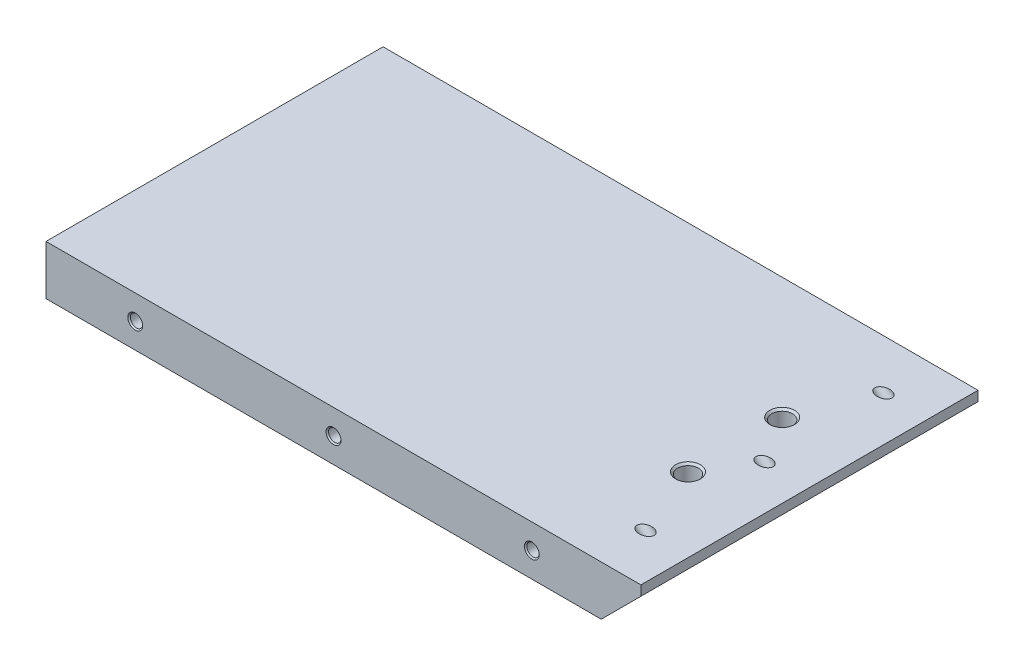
from build123d import *

# Parameters (mm, degrees)
ESQUISSE1_W                     = 120
ESQUISSE1_H                     = 10
EXTRUSION1_DEPTH                = 34
CHANFREIN1_SIZE                 = 8
R_P_TITION_LIN_AIRE1_COUNT      = 2
R_P_TITION_LIN_AIRE1_PITCH      = 58
R_P_TITION_LIN_AIRE2_COUNT      = 2
R_P_TITION_LIN_AIRE2_PITCH      = 45
TROU_TARAUD_M5X0_82_D           = 4.2
TROU_TARAUD_M5X0_82_CSINK_D     = 5
TROU_TARAUD_M5X0_82_CSINK_ANGLE = 90
R_P_TITION_LIN_AIRE3_COUNT      = 2
R_P_TITION_LIN_AIRE3_PITCH      = 19
TROU_TARAUD_M3X0_51_D           = 2.5
TROU_TARAUD_M3X0_51_CSINK_D     = 4
TROU_TARAUD_M3X0_51_CSINK_ANGLE = 90
R_P_TITION_LIN_AIRE4_COUNT      = 3
R_P_TITION_LIN_AIRE4_PITCH      = 24
R_P_TITION_LIN_AIRE5_COUNT      = 3
R_P_TITION_LIN_AIRE5_PITCH      = 40
R_P_TITION_LIN_AIRE6_COUNT      = 3
R_P_TITION_LIN_AIRE6_PITCH      = 40


with BuildPart() as part:
    # Esquisse1 → Extrusion1 (new, symmetric)
    with BuildSketch(Plane.XY):
        with Locations((60, 0)):
            Rectangle(ESQUISSE1_W, ESQUISSE1_H)
    extrude(amount=EXTRUSION1_DEPTH, both=True)

    # Chanfrein1
    chanfrein1_edges = [part.edges().sort_by_distance(p)[0] for p in [
        (120, -5, 0),
    ]]
    chamfer(chanfrein1_edges, length=CHANFREIN1_SIZE)

    # Esquisse2 → Trou taraud_ M5x0.81 (revolve, cut)
    with BuildSketch(Plane(origin=(0, 0, -29), x_dir=(0, 0, 1), z_dir=(0, 1, 0))):
        Polygon((0, 0), (0, 16.2618073), (2.1, 15), (2.1, 0.4), (2.5, 0), align=None)
    trou_taraud_m5x0_81 = revolve(axis=Axis((-6.35, 0, -29), (1, 0, 0)), mode=Mode.SUBTRACT)

    # R_p_tition lin_aire1: Trou taraud_ M5x0.81 ×2
    with Locations(*[(0, 0, i * R_P_TITION_LIN_AIRE1_PITCH) for i in range(1, R_P_TITION_LIN_AIRE1_COUNT)]):
        add(trou_taraud_m5x0_81, mode=Mode.SUBTRACT)

    # Esquisse6 → Diam_tre du per_age M5.0 _5.000000_1 (revolve, cut)
    with BuildSketch(Plane(origin=(0, 0, -22.5), x_dir=(0, 0, 1), z_dir=(0, 1, 0))):
        Polygon((0, 0), (0, 13.502151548), (2.5, 12), (2.5, 0.5), (3, 0), align=None)
    diam_tre_du_per_age_m5_0_5_000000_1 = revolve(axis=Axis((-6.35, 0, -22.5), (1, 0, 0)), mode=Mode.SUBTRACT)

    # R_p_tition lin_aire2: Diam_tre du per_age M5.0 _5.000000_1 ×2
    with Locations(*[(0, 0, i * R_P_TITION_LIN_AIRE2_PITCH) for i in range(1, R_P_TITION_LIN_AIRE2_COUNT)]):
        add(diam_tre_du_per_age_m5_0_5_000000_1, mode=Mode.SUBTRACT)

    # Trou taraud_ M5x0.82 (through all)
    with Locations(Plane(origin=(105, 5, 9.5), x_dir=(0, 0, 1), z_dir=(0, 1, 0))):
        with Locations((0, 0)):
            trou_taraud_m5x0_82 = CounterSinkHole(TROU_TARAUD_M5X0_82_D / 2, TROU_TARAUD_M5X0_82_CSINK_D / 2, counter_sink_angle=TROU_TARAUD_M5X0_82_CSINK_ANGLE)

    # R_p_tition lin_aire3: Trou taraud_ M5x0.82 ×2
    with Locations(*[(0, 0, -i * R_P_TITION_LIN_AIRE3_PITCH) for i in range(1, R_P_TITION_LIN_AIRE3_COUNT)]):
        add(trou_taraud_m5x0_82, mode=Mode.SUBTRACT)

    # Trou taraud_ M3x0.51 (through all)
    with Locations(Plane(origin=(58.5, -58.5, 0), x_dir=(0.7071067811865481, 0.7071067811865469, 0), z_dir=(0.7071067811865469, -0.7071067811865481, 0))):
        with Locations((81.974134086, 24)):
            trou_taraud_m3x0_51 = CounterSinkHole(TROU_TARAUD_M3X0_51_D / 2, TROU_TARAUD_M3X0_51_CSINK_D / 2, counter_sink_angle=TROU_TARAUD_M3X0_51_CSINK_ANGLE)

    # R_p_tition lin_aire4: Trou taraud_ M3x0.51 ×3
    with Locations(*[(0, 0, -i * R_P_TITION_LIN_AIRE4_PITCH) for i in range(1, R_P_TITION_LIN_AIRE4_COUNT)]):
        add(trou_taraud_m3x0_51, mode=Mode.SUBTRACT)

    # Esquisse10 → Trou taraud_ M3x0.52 (revolve, cut)
    with BuildSketch(Plane(origin=(18, 0, 34), x_dir=(0, -1, 0), z_dir=(1, 0, 0))):
        Polygon((0, 0), (0, 10.751075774), (1.25, 10), (1.25, 0.25), (1.5, 0), align=None)
    trou_taraud_m3x0_52 = revolve(axis=Axis((18, 0, 40.35), (0, 0, -1)), mode=Mode.SUBTRACT)

    # R_p_tition lin_aire5: Trou taraud_ M3x0.52 ×3
    with Locations(*[(i * R_P_TITION_LIN_AIRE5_PITCH, 0, 0) for i in range(1, R_P_TITION_LIN_AIRE5_COUNT)]):
        add(trou_taraud_m3x0_52, mode=Mode.SUBTRACT)

    # Esquisse11 → Trou taraud_ M3x0.53 (revolve, cut)
    with BuildSketch(Plane(origin=(18, 0, -34), x_dir=(0, 1, 0), z_dir=(1, 0, 0))):
        Polygon((0, 0), (0, 10.751075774), (1.25, 10), (1.25, 0.25), (1.5, 0), align=None)
    trou_taraud_m3x0_53 = revolve(axis=Axis((18, 0, -40.35), (0, 0, 1)), mode=Mode.SUBTRACT)

    # R_p_tition lin_aire6: Trou taraud_ M3x0.53 ×3
    with Locations(*[(i * R_P_TITION_LIN_AIRE6_PITCH, 0, 0) for i in range(1, R_P_TITION_LIN_AIRE6_COUNT)]):
        add(trou_taraud_m3x0_53, mode=Mode.SUBTRACT)


solid = part.part
